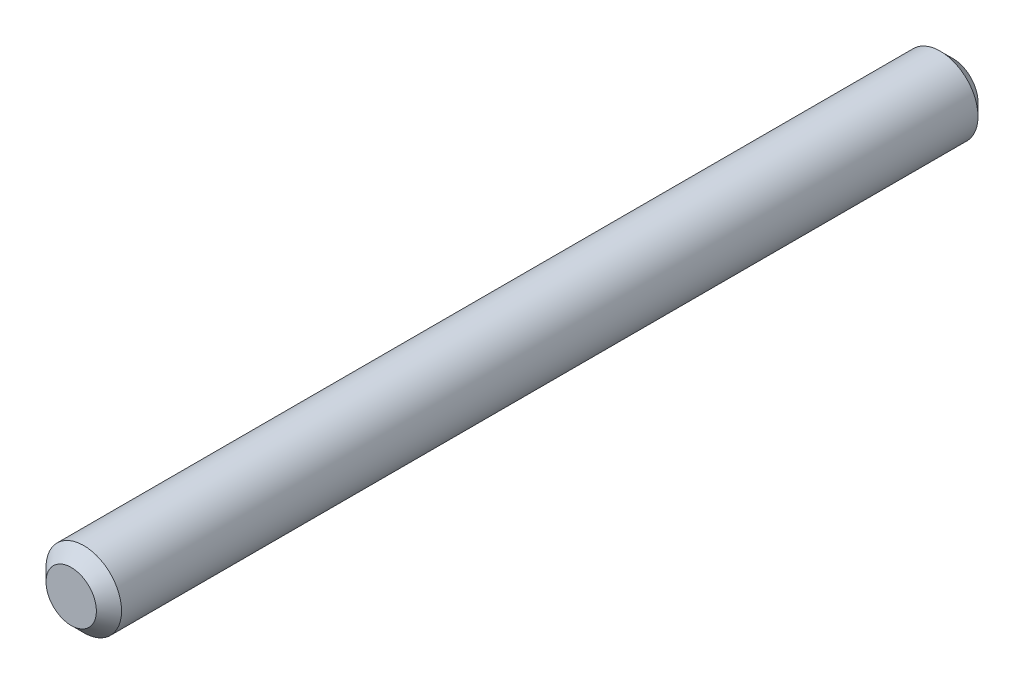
ISO-10303-21;
HEADER;
FILE_DESCRIPTION(('STEP AP214'),'2;1');
FILE_NAME('part.step','',(''),(''),'','','');
FILE_SCHEMA(('AUTOMOTIVE_DESIGN { 1 0 10303 214 1 1 1 1 }'));
ENDSEC;
DATA;
#1=APPLICATION_CONTEXT('core data for automotive mechanical design processes');
#2=APPLICATION_PROTOCOL_DEFINITION('international standard','automotive_design',2000,#1);
#3=PRODUCT_CONTEXT('',#1,'mechanical');
#4=PRODUCT('Part','Part','',(#3));
#5=PRODUCT_RELATED_PRODUCT_CATEGORY('part','',(#4));
#6=PRODUCT_DEFINITION_FORMATION('','',#4);
#7=PRODUCT_DEFINITION_CONTEXT('part definition',#1,'design');
#8=PRODUCT_DEFINITION('design','',#6,#7);
#9=PRODUCT_DEFINITION_SHAPE('','',#8);
#10=(LENGTH_UNIT() NAMED_UNIT(*) SI_UNIT(.MILLI.,.METRE.));
#11=(NAMED_UNIT(*) PLANE_ANGLE_UNIT() SI_UNIT($,.RADIAN.));
#12=(NAMED_UNIT(*) SI_UNIT($,.STERADIAN.) SOLID_ANGLE_UNIT());
#13=UNCERTAINTY_MEASURE_WITH_UNIT(LENGTH_MEASURE(1.E-05),#10,'distance_accuracy_value','');
#14=(GEOMETRIC_REPRESENTATION_CONTEXT(3) GLOBAL_UNCERTAINTY_ASSIGNED_CONTEXT((#13)) GLOBAL_UNIT_ASSIGNED_CONTEXT((#10,
#11,#12)) REPRESENTATION_CONTEXT('',''));
#15=CARTESIAN_POINT('',(0.,0.,0.));
#16=DIRECTION('',(0.,0.,1.));
#17=DIRECTION('',(1.,0.,0.));
#18=AXIS2_PLACEMENT_3D('',#15,#16,#17);
#19=CARTESIAN_POINT('',(0.,0.,35.));
#20=DIRECTION('',(0.,0.,-1.));
#21=DIRECTION('',(-1.,0.,0.));
#22=AXIS2_PLACEMENT_3D('',#19,#20,#21);
#23=CYLINDRICAL_SURFACE('',#22,1.5);
#24=CARTESIAN_POINT('',(0.,0.,0.499999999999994));
#25=DIRECTION('',(0.,0.,1.));
#26=DIRECTION('',(1.,0.,0.));
#27=AXIS2_PLACEMENT_3D('',#24,#25,#26);
#28=CIRCLE('',#27,1.5);
#29=CARTESIAN_POINT('',(1.5,0.,0.499999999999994));
#30=VERTEX_POINT('',#29);
#31=EDGE_CURVE('E39',#30,#30,#28,.T.);
#32=ORIENTED_EDGE('',*,*,#31,.T.);
#33=EDGE_LOOP('',(#32));
#34=FACE_BOUND('',#33,.T.);
#35=CARTESIAN_POINT('',(0.,0.,34.5));
#36=DIRECTION('',(0.,0.,1.));
#37=DIRECTION('',(1.,0.,0.));
#38=AXIS2_PLACEMENT_3D('',#35,#36,#37);
#39=CIRCLE('',#38,1.5);
#40=CARTESIAN_POINT('',(1.5,0.,34.5));
#41=VERTEX_POINT('',#40);
#42=EDGE_CURVE('E43',#41,#41,#39,.F.);
#43=ORIENTED_EDGE('',*,*,#42,.T.);
#44=EDGE_LOOP('',(#43));
#45=FACE_BOUND('',#44,.T.);
#46=ADVANCED_FACE('F29',(#34,#45),#23,.T.);
#47=CARTESIAN_POINT('',(0.,0.,35.));
#48=DIRECTION('',(0.,0.,1.));
#49=DIRECTION('',(1.,0.,0.));
#50=AXIS2_PLACEMENT_3D('',#47,#48,#49);
#51=PLANE('',#50);
#52=CARTESIAN_POINT('',(0.,0.,35.));
#53=DIRECTION('',(0.,0.,1.));
#54=DIRECTION('',(1.,0.,0.));
#55=AXIS2_PLACEMENT_3D('',#52,#53,#54);
#56=CIRCLE('',#55,1.00000000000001);
#57=CARTESIAN_POINT('',(1.00000000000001,0.,35.));
#58=VERTEX_POINT('',#57);
#59=EDGE_CURVE('E10',#58,#58,#56,.T.);
#60=ORIENTED_EDGE('',*,*,#59,.T.);
#61=EDGE_LOOP('',(#60));
#62=FACE_BOUND('',#61,.T.);
#63=ADVANCED_FACE('F62',(#62),#51,.T.);
#64=CARTESIAN_POINT('',(0.,0.,0.));
#65=DIRECTION('',(0.,0.,1.));
#66=DIRECTION('',(1.,0.,0.));
#67=AXIS2_PLACEMENT_3D('',#64,#65,#66);
#68=PLANE('',#67);
#69=CARTESIAN_POINT('',(0.,0.,0.));
#70=DIRECTION('',(0.,0.,1.));
#71=DIRECTION('',(1.,0.,0.));
#72=AXIS2_PLACEMENT_3D('',#69,#70,#71);
#73=CIRCLE('',#72,1.);
#74=CARTESIAN_POINT('',(1.,0.,0.));
#75=VERTEX_POINT('',#74);
#76=EDGE_CURVE('E35',#75,#75,#73,.F.);
#77=ORIENTED_EDGE('',*,*,#76,.T.);
#78=EDGE_LOOP('',(#77));
#79=FACE_BOUND('',#78,.T.);
#80=ADVANCED_FACE('F58',(#79),#68,.F.);
#81=CARTESIAN_POINT('',(0.,0.,0.499999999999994));
#82=DIRECTION('',(0.,0.,1.));
#83=DIRECTION('',(1.,0.,0.));
#84=AXIS2_PLACEMENT_3D('',#81,#82,#83);
#85=CONICAL_SURFACE('',#84,1.5,0.785398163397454);
#86=ORIENTED_EDGE('',*,*,#76,.F.);
#87=EDGE_LOOP('',(#86));
#88=FACE_BOUND('',#87,.T.);
#89=ORIENTED_EDGE('',*,*,#31,.F.);
#90=EDGE_LOOP('',(#89));
#91=FACE_BOUND('',#90,.T.);
#92=ADVANCED_FACE('F53',(#88,#91),#85,.T.);
#93=CARTESIAN_POINT('',(0.,0.,35.));
#94=DIRECTION('',(0.,0.,-1.));
#95=DIRECTION('',(-1.,0.,0.));
#96=AXIS2_PLACEMENT_3D('',#93,#94,#95);
#97=CONICAL_SURFACE('',#96,1.00000000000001,0.785398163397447);
#98=ORIENTED_EDGE('',*,*,#42,.F.);
#99=EDGE_LOOP('',(#98));
#100=FACE_BOUND('',#99,.T.);
#101=ORIENTED_EDGE('',*,*,#59,.F.);
#102=EDGE_LOOP('',(#101));
#103=FACE_BOUND('',#102,.T.);
#104=ADVANCED_FACE('F50',(#100,#103),#97,.T.);
#105=CLOSED_SHELL('',(#46,#63,#80,#92,#104));
#106=MANIFOLD_SOLID_BREP('B2',#105);
#107=ADVANCED_BREP_SHAPE_REPRESENTATION('',(#18,#106),#14);
#108=SHAPE_DEFINITION_REPRESENTATION(#9,#107);
ENDSEC;
END-ISO-10303-21;
